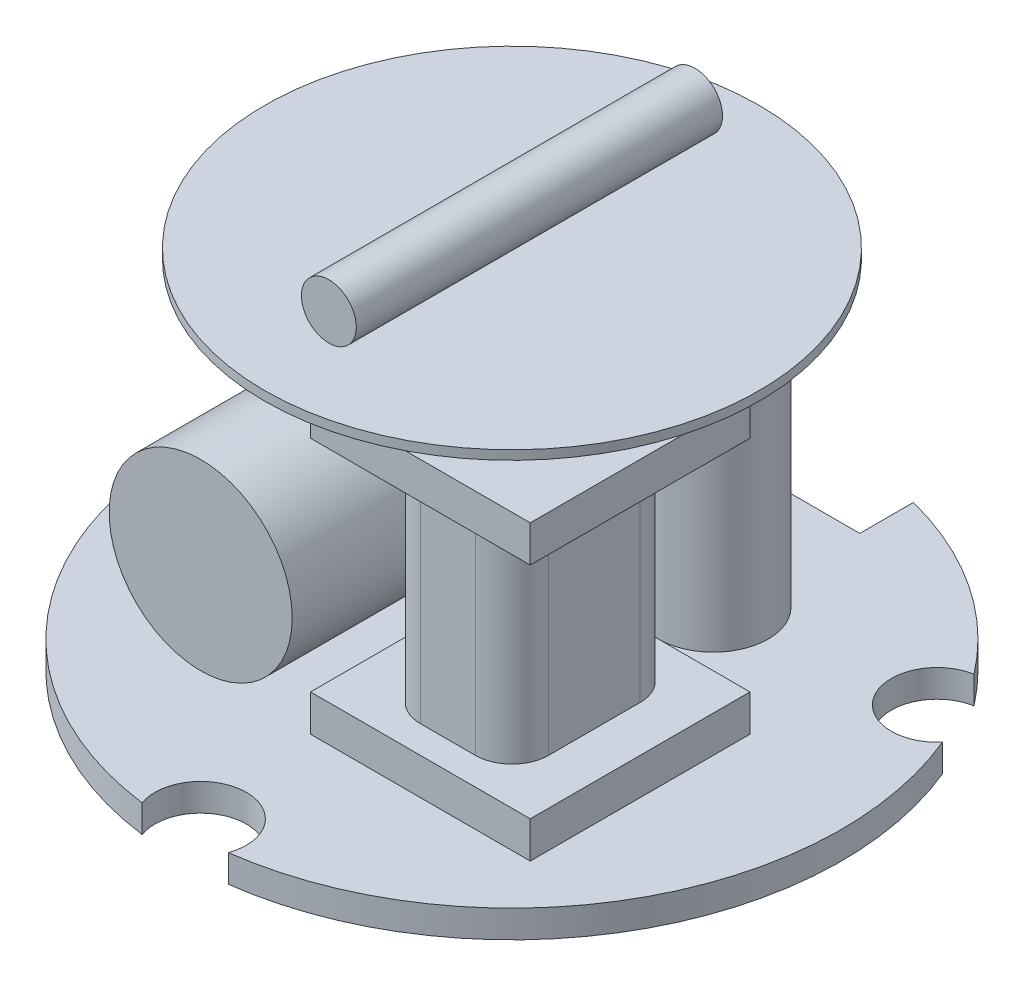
ISO-10303-21;
HEADER;
FILE_DESCRIPTION(('STEP AP214'),'2;1');
FILE_NAME('part.step','',(''),(''),'','','');
FILE_SCHEMA(('AUTOMOTIVE_DESIGN { 1 0 10303 214 1 1 1 1 }'));
ENDSEC;
DATA;
#1=APPLICATION_CONTEXT('core data for automotive mechanical design processes');
#2=APPLICATION_PROTOCOL_DEFINITION('international standard','automotive_design',2000,#1);
#3=PRODUCT_CONTEXT('',#1,'mechanical');
#4=PRODUCT('Part','Part','',(#3));
#5=PRODUCT_RELATED_PRODUCT_CATEGORY('part','',(#4));
#6=PRODUCT_DEFINITION_FORMATION('','',#4);
#7=PRODUCT_DEFINITION_CONTEXT('part definition',#1,'design');
#8=PRODUCT_DEFINITION('design','',#6,#7);
#9=PRODUCT_DEFINITION_SHAPE('','',#8);
#10=(LENGTH_UNIT() NAMED_UNIT(*) SI_UNIT(.MILLI.,.METRE.));
#11=(NAMED_UNIT(*) PLANE_ANGLE_UNIT() SI_UNIT($,.RADIAN.));
#12=(NAMED_UNIT(*) SI_UNIT($,.STERADIAN.) SOLID_ANGLE_UNIT());
#13=UNCERTAINTY_MEASURE_WITH_UNIT(LENGTH_MEASURE(1.E-05),#10,'distance_accuracy_value','');
#14=(GEOMETRIC_REPRESENTATION_CONTEXT(3) GLOBAL_UNCERTAINTY_ASSIGNED_CONTEXT((#13)) GLOBAL_UNIT_ASSIGNED_CONTEXT((#10,
#11,#12)) REPRESENTATION_CONTEXT('',''));
#15=CARTESIAN_POINT('',(0.,0.,0.));
#16=DIRECTION('',(0.,0.,1.));
#17=DIRECTION('',(1.,0.,0.));
#18=AXIS2_PLACEMENT_3D('',#15,#16,#17);
#19=CARTESIAN_POINT('',(0.,22.,10.));
#20=DIRECTION('',(0.,0.,-1.));
#21=DIRECTION('',(-1.,0.,0.));
#22=AXIS2_PLACEMENT_3D('',#19,#20,#21);
#23=CYLINDRICAL_SURFACE('',#22,1.5);
#24=CARTESIAN_POINT('',(0.,22.,10.));
#25=DIRECTION('',(0.,0.,1.));
#26=DIRECTION('',(1.,0.,0.));
#27=AXIS2_PLACEMENT_3D('',#24,#25,#26);
#28=CIRCLE('',#27,1.5);
#29=CARTESIAN_POINT('',(1.5,22.,10.));
#30=VERTEX_POINT('',#29);
#31=EDGE_CURVE('E11',#30,#30,#28,.T.);
#32=ORIENTED_EDGE('',*,*,#31,.F.);
#33=EDGE_LOOP('',(#32));
#34=FACE_BOUND('',#33,.T.);
#35=CARTESIAN_POINT('',(0.,22.,-10.));
#36=DIRECTION('',(0.,0.,1.));
#37=DIRECTION('',(1.,0.,0.));
#38=AXIS2_PLACEMENT_3D('',#35,#36,#37);
#39=CIRCLE('',#38,1.5);
#40=CARTESIAN_POINT('',(1.5,22.,-10.));
#41=VERTEX_POINT('',#40);
#42=EDGE_CURVE('E46',#41,#41,#39,.T.);
#43=ORIENTED_EDGE('',*,*,#42,.T.);
#44=EDGE_LOOP('',(#43));
#45=FACE_BOUND('',#44,.T.);
#46=ADVANCED_FACE('F40',(#34,#45),#23,.T.);
#47=CARTESIAN_POINT('',(0.,22.,10.));
#48=DIRECTION('',(0.,0.,1.));
#49=DIRECTION('',(1.,0.,0.));
#50=AXIS2_PLACEMENT_3D('',#47,#48,#49);
#51=PLANE('',#50);
#52=ORIENTED_EDGE('',*,*,#31,.T.);
#53=EDGE_LOOP('',(#52));
#54=FACE_BOUND('',#53,.T.);
#55=ADVANCED_FACE('F55',(#54),#51,.T.);
#56=CARTESIAN_POINT('',(0.,22.,-10.));
#57=DIRECTION('',(0.,0.,1.));
#58=DIRECTION('',(1.,0.,0.));
#59=AXIS2_PLACEMENT_3D('',#56,#57,#58);
#60=PLANE('',#59);
#61=ORIENTED_EDGE('',*,*,#42,.F.);
#62=EDGE_LOOP('',(#61));
#63=FACE_BOUND('',#62,.T.);
#64=ADVANCED_FACE('F53',(#63),#60,.F.);
#65=CLOSED_SHELL('',(#46,#55,#64));
#66=MANIFOLD_SOLID_BREP('B2',#65);
#67=CARTESIAN_POINT('',(-7.,6.5,10.));
#68=DIRECTION('',(0.,0.,-1.));
#69=DIRECTION('',(-1.,0.,0.));
#70=AXIS2_PLACEMENT_3D('',#67,#68,#69);
#71=CYLINDRICAL_SURFACE('',#70,5.);
#72=CARTESIAN_POINT('',(-7.,6.5,10.));
#73=DIRECTION('',(0.,0.,1.));
#74=DIRECTION('',(1.,0.,0.));
#75=AXIS2_PLACEMENT_3D('',#72,#73,#74);
#76=CIRCLE('',#75,5.);
#77=CARTESIAN_POINT('',(-2.,6.5,10.));
#78=VERTEX_POINT('',#77);
#79=EDGE_CURVE('E39',#78,#78,#76,.T.);
#80=ORIENTED_EDGE('',*,*,#79,.F.);
#81=EDGE_LOOP('',(#80));
#82=FACE_BOUND('',#81,.T.);
#83=CARTESIAN_POINT('',(-7.,6.5,-4.));
#84=DIRECTION('',(0.,0.,1.));
#85=DIRECTION('',(1.,0.,0.));
#86=AXIS2_PLACEMENT_3D('',#83,#84,#85);
#87=CIRCLE('',#86,5.);
#88=CARTESIAN_POINT('',(-2.,6.5,-4.));
#89=VERTEX_POINT('',#88);
#90=EDGE_CURVE('E96',#89,#89,#87,.T.);
#91=ORIENTED_EDGE('',*,*,#90,.T.);
#92=EDGE_LOOP('',(#91));
#93=FACE_BOUND('',#92,.T.);
#94=ADVANCED_FACE('F90',(#82,#93),#71,.T.);
#95=CARTESIAN_POINT('',(-7.,6.5,10.));
#96=DIRECTION('',(0.,0.,1.));
#97=DIRECTION('',(1.,0.,0.));
#98=AXIS2_PLACEMENT_3D('',#95,#96,#97);
#99=PLANE('',#98);
#100=ORIENTED_EDGE('',*,*,#79,.T.);
#101=EDGE_LOOP('',(#100));
#102=FACE_BOUND('',#101,.T.);
#103=ADVANCED_FACE('F105',(#102),#99,.T.);
#104=CARTESIAN_POINT('',(-7.,6.5,-4.));
#105=DIRECTION('',(0.,0.,1.));
#106=DIRECTION('',(1.,0.,0.));
#107=AXIS2_PLACEMENT_3D('',#104,#105,#106);
#108=PLANE('',#107);
#109=ORIENTED_EDGE('',*,*,#90,.F.);
#110=EDGE_LOOP('',(#109));
#111=FACE_BOUND('',#110,.T.);
#112=ADVANCED_FACE('F103',(#111),#108,.F.);
#113=CLOSED_SHELL('',(#94,#103,#112));
#114=MANIFOLD_SOLID_BREP('B6',#113);
#115=CARTESIAN_POINT('',(11.,17.5,10.));
#116=DIRECTION('',(0.,-1.,0.));
#117=DIRECTION('',(0.,0.,-1.));
#118=AXIS2_PLACEMENT_3D('',#115,#116,#117);
#119=PLANE('',#118);
#120=DIRECTION('',(0.,0.,-1.));
#121=VECTOR('',#120,1.);
#122=CARTESIAN_POINT('',(11.,17.5,-2.));
#123=LINE('',#122,#121);
#124=CARTESIAN_POINT('',(11.,17.5,10.));
#125=VERTEX_POINT('',#124);
#126=CARTESIAN_POINT('',(11.,17.5,-2.));
#127=VERTEX_POINT('',#126);
#128=EDGE_CURVE('E398',#125,#127,#123,.T.);
#129=ORIENTED_EDGE('',*,*,#128,.T.);
#130=DIRECTION('',(-1.,0.,0.));
#131=VECTOR('',#130,1.);
#132=CARTESIAN_POINT('',(11.,17.5,-2.));
#133=LINE('',#132,#131);
#134=CARTESIAN_POINT('',(-1.,17.5,-2.));
#135=VERTEX_POINT('',#134);
#136=EDGE_CURVE('E401',#127,#135,#133,.T.);
#137=ORIENTED_EDGE('',*,*,#136,.T.);
#138=DIRECTION('',(0.,0.,1.));
#139=VECTOR('',#138,1.);
#140=CARTESIAN_POINT('',(-1.,17.5,-2.));
#141=LINE('',#140,#139);
#142=CARTESIAN_POINT('',(-1.,17.5,10.));
#143=VERTEX_POINT('',#142);
#144=EDGE_CURVE('E403',#135,#143,#141,.T.);
#145=ORIENTED_EDGE('',*,*,#144,.T.);
#146=DIRECTION('',(1.,0.,0.));
#147=VECTOR('',#146,1.);
#148=CARTESIAN_POINT('',(11.,17.5,10.));
#149=LINE('',#148,#147);
#150=EDGE_CURVE('E405',#143,#125,#149,.T.);
#151=ORIENTED_EDGE('',*,*,#150,.T.);
#152=EDGE_LOOP('',(#129,#137,#145,#151));
#153=FACE_BOUND('',#152,.T.);
#154=DIRECTION('',(0.,0.,-1.));
#155=VECTOR('',#154,1.);
#156=CARTESIAN_POINT('',(7.5,17.5,1.5));
#157=LINE('',#156,#155);
#158=CARTESIAN_POINT('',(7.5,17.5,6.5));
#159=VERTEX_POINT('',#158);
#160=CARTESIAN_POINT('',(7.5,17.5,1.5));
#161=VERTEX_POINT('',#160);
#162=EDGE_CURVE('E1182',#159,#161,#157,.T.);
#163=ORIENTED_EDGE('',*,*,#162,.F.);
#164=DIRECTION('',(1.,0.,0.));
#165=VECTOR('',#164,1.);
#166=CARTESIAN_POINT('',(7.5,17.5,6.5));
#167=LINE('',#166,#165);
#168=CARTESIAN_POINT('',(2.5,17.5,6.5));
#169=VERTEX_POINT('',#168);
#170=EDGE_CURVE('E366',#169,#159,#167,.T.);
#171=ORIENTED_EDGE('',*,*,#170,.F.);
#172=DIRECTION('',(0.,0.,1.));
#173=VECTOR('',#172,1.);
#174=CARTESIAN_POINT('',(2.5,17.5,1.5));
#175=LINE('',#174,#173);
#176=CARTESIAN_POINT('',(2.5,17.5,1.5));
#177=VERTEX_POINT('',#176);
#178=EDGE_CURVE('E151',#177,#169,#175,.T.);
#179=ORIENTED_EDGE('',*,*,#178,.F.);
#180=DIRECTION('',(-1.,0.,0.));
#181=VECTOR('',#180,1.);
#182=CARTESIAN_POINT('',(7.5,17.5,1.5));
#183=LINE('',#182,#181);
#184=EDGE_CURVE('E146',#161,#177,#183,.T.);
#185=ORIENTED_EDGE('',*,*,#184,.F.);
#186=EDGE_LOOP('',(#163,#171,#179,#185));
#187=FACE_BOUND('',#186,.T.);
#188=ADVANCED_FACE('F131',(#153,#187),#119,.F.);
#189=CARTESIAN_POINT('',(11.,3.5,10.));
#190=DIRECTION('',(0.,-1.,0.));
#191=DIRECTION('',(0.,0.,-1.));
#192=AXIS2_PLACEMENT_3D('',#189,#190,#191);
#193=PLANE('',#192);
#194=DIRECTION('',(0.,0.,-1.));
#195=VECTOR('',#194,1.);
#196=CARTESIAN_POINT('',(11.,3.5,-2.));
#197=LINE('',#196,#195);
#198=CARTESIAN_POINT('',(11.,3.5,10.));
#199=VERTEX_POINT('',#198);
#200=CARTESIAN_POINT('',(11.,3.5,-2.));
#201=VERTEX_POINT('',#200);
#202=EDGE_CURVE('E501',#199,#201,#197,.T.);
#203=ORIENTED_EDGE('',*,*,#202,.T.);
#204=DIRECTION('',(-1.,0.,0.));
#205=VECTOR('',#204,1.);
#206=CARTESIAN_POINT('',(11.,3.5,-2.));
#207=LINE('',#206,#205);
#208=CARTESIAN_POINT('',(-1.,3.5,-2.));
#209=VERTEX_POINT('',#208);
#210=EDGE_CURVE('E504',#201,#209,#207,.T.);
#211=ORIENTED_EDGE('',*,*,#210,.T.);
#212=DIRECTION('',(0.,0.,1.));
#213=VECTOR('',#212,1.);
#214=CARTESIAN_POINT('',(-1.,3.5,-2.));
#215=LINE('',#214,#213);
#216=CARTESIAN_POINT('',(-0.999999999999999,3.5,10.));
#217=VERTEX_POINT('',#216);
#218=EDGE_CURVE('E506',#209,#217,#215,.T.);
#219=ORIENTED_EDGE('',*,*,#218,.T.);
#220=DIRECTION('',(1.,0.,0.));
#221=VECTOR('',#220,1.);
#222=CARTESIAN_POINT('',(11.,3.5,10.));
#223=LINE('',#222,#221);
#224=EDGE_CURVE('E508',#217,#199,#223,.T.);
#225=ORIENTED_EDGE('',*,*,#224,.T.);
#226=EDGE_LOOP('',(#203,#211,#219,#225));
#227=FACE_BOUND('',#226,.T.);
#228=CARTESIAN_POINT('',(6.5,3.5,6.5));
#229=DIRECTION('',(0.,1.,0.));
#230=DIRECTION('',(0.,0.,1.));
#231=AXIS2_PLACEMENT_3D('',#228,#229,#230);
#232=CIRCLE('',#231,2.);
#233=CARTESIAN_POINT('',(6.5,3.5,8.5));
#234=VERTEX_POINT('',#233);
#235=CARTESIAN_POINT('',(8.5,3.5,6.5));
#236=VERTEX_POINT('',#235);
#237=EDGE_CURVE('E419',#234,#236,#232,.T.);
#238=ORIENTED_EDGE('',*,*,#237,.F.);
#239=DIRECTION('',(1.,0.,0.));
#240=VECTOR('',#239,1.);
#241=CARTESIAN_POINT('',(6.5,3.5,8.5));
#242=LINE('',#241,#240);
#243=CARTESIAN_POINT('',(3.5,3.5,8.5));
#244=VERTEX_POINT('',#243);
#245=EDGE_CURVE('E440',#244,#234,#242,.T.);
#246=ORIENTED_EDGE('',*,*,#245,.F.);
#247=CARTESIAN_POINT('',(3.5,3.5,6.5));
#248=DIRECTION('',(0.,1.,0.));
#249=DIRECTION('',(0.,0.,1.));
#250=AXIS2_PLACEMENT_3D('',#247,#248,#249);
#251=CIRCLE('',#250,2.);
#252=CARTESIAN_POINT('',(1.5,3.5,6.5));
#253=VERTEX_POINT('',#252);
#254=EDGE_CURVE('E437',#253,#244,#251,.T.);
#255=ORIENTED_EDGE('',*,*,#254,.F.);
#256=DIRECTION('',(0.,0.,1.));
#257=VECTOR('',#256,1.);
#258=CARTESIAN_POINT('',(1.5,3.5,1.5));
#259=LINE('',#258,#257);
#260=CARTESIAN_POINT('',(1.5,3.5,1.5));
#261=VERTEX_POINT('',#260);
#262=EDGE_CURVE('E434',#261,#253,#259,.T.);
#263=ORIENTED_EDGE('',*,*,#262,.F.);
#264=CARTESIAN_POINT('',(3.5,3.5,1.5));
#265=DIRECTION('',(0.,1.,0.));
#266=DIRECTION('',(0.,0.,1.));
#267=AXIS2_PLACEMENT_3D('',#264,#265,#266);
#268=CIRCLE('',#267,2.);
#269=CARTESIAN_POINT('',(3.5,3.5,-0.499999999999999));
#270=VERTEX_POINT('',#269);
#271=EDGE_CURVE('E431',#270,#261,#268,.T.);
#272=ORIENTED_EDGE('',*,*,#271,.F.);
#273=DIRECTION('',(-1.,0.,0.));
#274=VECTOR('',#273,1.);
#275=CARTESIAN_POINT('',(6.5,3.5,-0.499999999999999));
#276=LINE('',#275,#274);
#277=CARTESIAN_POINT('',(6.5,3.5,-0.499999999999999));
#278=VERTEX_POINT('',#277);
#279=EDGE_CURVE('E428',#278,#270,#276,.T.);
#280=ORIENTED_EDGE('',*,*,#279,.F.);
#281=CARTESIAN_POINT('',(6.5,3.5,1.5));
#282=DIRECTION('',(0.,1.,0.));
#283=DIRECTION('',(0.,0.,1.));
#284=AXIS2_PLACEMENT_3D('',#281,#282,#283);
#285=CIRCLE('',#284,2.);
#286=CARTESIAN_POINT('',(8.5,3.5,1.5));
#287=VERTEX_POINT('',#286);
#288=EDGE_CURVE('E425',#287,#278,#285,.T.);
#289=ORIENTED_EDGE('',*,*,#288,.F.);
#290=DIRECTION('',(0.,0.,-1.));
#291=VECTOR('',#290,1.);
#292=CARTESIAN_POINT('',(8.5,3.5,1.5));
#293=LINE('',#292,#291);
#294=EDGE_CURVE('E422',#236,#287,#293,.T.);
#295=ORIENTED_EDGE('',*,*,#294,.F.);
#296=EDGE_LOOP('',(#238,#246,#255,#263,#272,#280,#289,#295));
#297=FACE_BOUND('',#296,.T.);
#298=ADVANCED_FACE('F674',(#227,#297),#193,.F.);
#299=CARTESIAN_POINT('',(14.7224318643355,1.5,-8.49999999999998));
#300=DIRECTION('',(0.,1.,0.));
#301=DIRECTION('',(0.,0.,1.));
#302=AXIS2_PLACEMENT_3D('',#299,#300,#301);
#303=PLANE('',#302);
#304=DIRECTION('',(-1.,0.,0.));
#305=VECTOR('',#304,1.);
#306=CARTESIAN_POINT('',(-2.,1.5,-9.));
#307=LINE('',#306,#305);
#308=CARTESIAN_POINT('',(-2.,1.5,-9.));
#309=VERTEX_POINT('',#308);
#310=CARTESIAN_POINT('',(-7.,1.5,-9.));
#311=VERTEX_POINT('',#310);
#312=EDGE_CURVE('E526',#309,#311,#307,.T.);
#313=ORIENTED_EDGE('',*,*,#312,.F.);
#314=DIRECTION('',(0.,0.,-1.));
#315=VECTOR('',#314,1.);
#316=CARTESIAN_POINT('',(-2.,1.5,-9.));
#317=LINE('',#316,#315);
#318=CARTESIAN_POINT('',(-2.,1.5,-5.));
#319=VERTEX_POINT('',#318);
#320=EDGE_CURVE('E523',#319,#309,#317,.T.);
#321=ORIENTED_EDGE('',*,*,#320,.F.);
#322=DIRECTION('',(1.,0.,0.));
#323=VECTOR('',#322,1.);
#324=CARTESIAN_POINT('',(-2.,1.5,-5.));
#325=LINE('',#324,#323);
#326=CARTESIAN_POINT('',(-7.,1.5,-5.));
#327=VERTEX_POINT('',#326);
#328=EDGE_CURVE('E532',#327,#319,#325,.T.);
#329=ORIENTED_EDGE('',*,*,#328,.F.);
#330=DIRECTION('',(0.,0.,1.));
#331=VECTOR('',#330,1.);
#332=CARTESIAN_POINT('',(-7.,1.5,-9.));
#333=LINE('',#332,#331);
#334=EDGE_CURVE('E529',#311,#327,#333,.T.);
#335=ORIENTED_EDGE('',*,*,#334,.F.);
#336=EDGE_LOOP('',(#313,#321,#329,#335));
#337=FACE_BOUND('',#336,.T.);
#338=CARTESIAN_POINT('',(14.7224318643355,1.5,-8.49999999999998));
#339=DIRECTION('',(0.,-1.,0.));
#340=DIRECTION('',(0.,0.,1.));
#341=AXIS2_PLACEMENT_3D('',#338,#339,#340);
#342=CIRCLE('',#341,2.5);
#343=CARTESIAN_POINT('',(16.6310597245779,1.5,-6.88533604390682));
#344=VERTEX_POINT('',#343);
#345=CARTESIAN_POINT('',(14.278405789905,1.5,-10.9602521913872));
#346=VERTEX_POINT('',#345);
#347=EDGE_CURVE('E573',#344,#346,#342,.T.);
#348=ORIENTED_EDGE('',*,*,#347,.T.);
#349=CARTESIAN_POINT('',(0.,1.5,0.));
#350=DIRECTION('',(0.,1.,0.));
#351=DIRECTION('',(0.,0.,1.));
#352=AXIS2_PLACEMENT_3D('',#349,#350,#351);
#353=CIRCLE('',#352,18.);
#354=CARTESIAN_POINT('',(4.49999999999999,1.5,-17.4284250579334));
#355=VERTEX_POINT('',#354);
#356=EDGE_CURVE('E576',#346,#355,#353,.T.);
#357=ORIENTED_EDGE('',*,*,#356,.T.);
#358=DIRECTION('',(0.,0.,1.));
#359=VECTOR('',#358,1.);
#360=CARTESIAN_POINT('',(4.49999999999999,1.5,-17.4284250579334));
#361=LINE('',#360,#359);
#362=CARTESIAN_POINT('',(4.5,1.5,-14.5));
#363=VERTEX_POINT('',#362);
#364=EDGE_CURVE('E578',#355,#363,#361,.T.);
#365=ORIENTED_EDGE('',*,*,#364,.T.);
#366=DIRECTION('',(-1.,0.,0.));
#367=VECTOR('',#366,1.);
#368=CARTESIAN_POINT('',(-4.5,1.5,-14.5));
#369=LINE('',#368,#367);
#370=CARTESIAN_POINT('',(-4.5,1.5,-14.5));
#371=VERTEX_POINT('',#370);
#372=EDGE_CURVE('E580',#363,#371,#369,.T.);
#373=ORIENTED_EDGE('',*,*,#372,.T.);
#374=DIRECTION('',(0.,0.,-1.));
#375=VECTOR('',#374,1.);
#376=CARTESIAN_POINT('',(-4.5,1.5,-17.4284250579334));
#377=LINE('',#376,#375);
#378=CARTESIAN_POINT('',(-4.49999999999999,1.5,-17.4284250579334));
#379=VERTEX_POINT('',#378);
#380=EDGE_CURVE('E582',#371,#379,#377,.T.);
#381=ORIENTED_EDGE('',*,*,#380,.T.);
#382=CARTESIAN_POINT('',(0.,1.5,0.));
#383=DIRECTION('',(0.,1.,0.));
#384=DIRECTION('',(0.,0.,1.));
#385=AXIS2_PLACEMENT_3D('',#382,#383,#384);
#386=CIRCLE('',#385,18.);
#387=CARTESIAN_POINT('',(-14.278405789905,1.5,-10.9602521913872));
#388=VERTEX_POINT('',#387);
#389=EDGE_CURVE('E584',#379,#388,#386,.T.);
#390=ORIENTED_EDGE('',*,*,#389,.T.);
#391=CARTESIAN_POINT('',(-14.7224318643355,1.5,-8.49999999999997));
#392=DIRECTION('',(0.,-1.,0.));
#393=DIRECTION('',(0.,0.,-1.));
#394=AXIS2_PLACEMENT_3D('',#391,#392,#393);
#395=CIRCLE('',#394,2.5);
#396=CARTESIAN_POINT('',(-16.6310597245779,1.5,-6.88533604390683));
#397=VERTEX_POINT('',#396);
#398=EDGE_CURVE('E586',#388,#397,#395,.T.);
#399=ORIENTED_EDGE('',*,*,#398,.T.);
#400=CARTESIAN_POINT('',(0.,1.5,0.));
#401=DIRECTION('',(0.,1.,0.));
#402=DIRECTION('',(0.,0.,1.));
#403=AXIS2_PLACEMENT_3D('',#400,#401,#402);
#404=CIRCLE('',#403,18.);
#405=CARTESIAN_POINT('',(-2.35265393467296,1.5,17.8455882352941));
#406=VERTEX_POINT('',#405);
#407=EDGE_CURVE('E588',#397,#406,#404,.T.);
#408=ORIENTED_EDGE('',*,*,#407,.T.);
#409=CARTESIAN_POINT('',(0.,1.5,17.));
#410=DIRECTION('',(0.,-1.,0.));
#411=DIRECTION('',(0.,0.,1.));
#412=AXIS2_PLACEMENT_3D('',#409,#410,#411);
#413=CIRCLE('',#412,2.5);
#414=CARTESIAN_POINT('',(2.35265393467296,1.5,17.8455882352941));
#415=VERTEX_POINT('',#414);
#416=EDGE_CURVE('E590',#406,#415,#413,.T.);
#417=ORIENTED_EDGE('',*,*,#416,.T.);
#418=CARTESIAN_POINT('',(0.,1.5,0.));
#419=DIRECTION('',(0.,1.,0.));
#420=DIRECTION('',(0.,0.,1.));
#421=AXIS2_PLACEMENT_3D('',#418,#419,#420);
#422=CIRCLE('',#421,18.);
#423=EDGE_CURVE('E592',#415,#344,#422,.T.);
#424=ORIENTED_EDGE('',*,*,#423,.T.);
#425=EDGE_LOOP('',(#348,#357,#365,#373,#381,#390,#399,#408,#417,#424));
#426=FACE_BOUND('',#425,.T.);
#427=CARTESIAN_POINT('',(4.,1.5,-7.));
#428=DIRECTION('',(0.,1.,0.));
#429=DIRECTION('',(0.,0.,1.));
#430=AXIS2_PLACEMENT_3D('',#427,#428,#429);
#431=CIRCLE('',#430,3.);
#432=CARTESIAN_POINT('',(4.,1.5,-4.));
#433=VERTEX_POINT('',#432);
#434=EDGE_CURVE('E543',#433,#433,#431,.T.);
#435=ORIENTED_EDGE('',*,*,#434,.F.);
#436=EDGE_LOOP('',(#435));
#437=FACE_BOUND('',#436,.T.);
#438=DIRECTION('',(-1.,0.,0.));
#439=VECTOR('',#438,1.);
#440=CARTESIAN_POINT('',(11.,1.5,-2.));
#441=LINE('',#440,#439);
#442=CARTESIAN_POINT('',(11.,1.5,-2.));
#443=VERTEX_POINT('',#442);
#444=CARTESIAN_POINT('',(-1.,1.5,-2.));
#445=VERTEX_POINT('',#444);
#446=EDGE_CURVE('E494',#443,#445,#441,.T.);
#447=ORIENTED_EDGE('',*,*,#446,.F.);
#448=DIRECTION('',(0.,0.,-1.));
#449=VECTOR('',#448,1.);
#450=CARTESIAN_POINT('',(11.,1.5,-2.));
#451=LINE('',#450,#449);
#452=CARTESIAN_POINT('',(11.,1.5,10.));
#453=VERTEX_POINT('',#452);
#454=EDGE_CURVE('E491',#453,#443,#451,.T.);
#455=ORIENTED_EDGE('',*,*,#454,.F.);
#456=DIRECTION('',(1.,0.,0.));
#457=VECTOR('',#456,1.);
#458=CARTESIAN_POINT('',(11.,1.5,10.));
#459=LINE('',#458,#457);
#460=CARTESIAN_POINT('',(-0.999999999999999,1.5,10.));
#461=VERTEX_POINT('',#460);
#462=EDGE_CURVE('E499',#461,#453,#459,.T.);
#463=ORIENTED_EDGE('',*,*,#462,.F.);
#464=DIRECTION('',(0.,0.,1.));
#465=VECTOR('',#464,1.);
#466=CARTESIAN_POINT('',(-1.,1.5,-2.));
#467=LINE('',#466,#465);
#468=EDGE_CURVE('E496',#445,#461,#467,.T.);
#469=ORIENTED_EDGE('',*,*,#468,.F.);
#470=EDGE_LOOP('',(#447,#455,#463,#469));
#471=FACE_BOUND('',#470,.T.);
#472=ADVANCED_FACE('F660',(#337,#426,#437,#471),#303,.T.);
#473=CARTESIAN_POINT('',(14.7224318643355,0.,-8.49999999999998));
#474=DIRECTION('',(0.,1.,0.));
#475=DIRECTION('',(0.,0.,1.));
#476=AXIS2_PLACEMENT_3D('',#473,#474,#475);
#477=PLANE('',#476);
#478=CARTESIAN_POINT('',(14.7224318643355,0.,-8.49999999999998));
#479=DIRECTION('',(0.,-1.,0.));
#480=DIRECTION('',(0.,0.,1.));
#481=AXIS2_PLACEMENT_3D('',#478,#479,#480);
#482=CIRCLE('',#481,2.5);
#483=CARTESIAN_POINT('',(16.6310597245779,0.,-6.88533604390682));
#484=VERTEX_POINT('',#483);
#485=CARTESIAN_POINT('',(14.278405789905,0.,-10.9602521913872));
#486=VERTEX_POINT('',#485);
#487=EDGE_CURVE('E552',#484,#486,#482,.T.);
#488=ORIENTED_EDGE('',*,*,#487,.F.);
#489=CARTESIAN_POINT('',(0.,0.,0.));
#490=DIRECTION('',(0.,1.,0.));
#491=DIRECTION('',(0.,0.,1.));
#492=AXIS2_PLACEMENT_3D('',#489,#490,#491);
#493=CIRCLE('',#492,18.);
#494=CARTESIAN_POINT('',(2.35265393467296,0.,17.8455882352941));
#495=VERTEX_POINT('',#494);
#496=EDGE_CURVE('E571',#495,#484,#493,.T.);
#497=ORIENTED_EDGE('',*,*,#496,.F.);
#498=CARTESIAN_POINT('',(0.,0.,17.));
#499=DIRECTION('',(0.,-1.,0.));
#500=DIRECTION('',(0.,0.,1.));
#501=AXIS2_PLACEMENT_3D('',#498,#499,#500);
#502=CIRCLE('',#501,2.5);
#503=CARTESIAN_POINT('',(-2.35265393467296,0.,17.8455882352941));
#504=VERTEX_POINT('',#503);
#505=EDGE_CURVE('E569',#504,#495,#502,.T.);
#506=ORIENTED_EDGE('',*,*,#505,.F.);
#507=CARTESIAN_POINT('',(0.,0.,0.));
#508=DIRECTION('',(0.,1.,0.));
#509=DIRECTION('',(0.,0.,1.));
#510=AXIS2_PLACEMENT_3D('',#507,#508,#509);
#511=CIRCLE('',#510,18.);
#512=CARTESIAN_POINT('',(-16.6310597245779,0.,-6.88533604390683));
#513=VERTEX_POINT('',#512);
#514=EDGE_CURVE('E567',#513,#504,#511,.T.);
#515=ORIENTED_EDGE('',*,*,#514,.F.);
#516=CARTESIAN_POINT('',(-14.7224318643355,0.,-8.49999999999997));
#517=DIRECTION('',(0.,-1.,0.));
#518=DIRECTION('',(0.,0.,-1.));
#519=AXIS2_PLACEMENT_3D('',#516,#517,#518);
#520=CIRCLE('',#519,2.5);
#521=CARTESIAN_POINT('',(-14.278405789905,0.,-10.9602521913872));
#522=VERTEX_POINT('',#521);
#523=EDGE_CURVE('E565',#522,#513,#520,.T.);
#524=ORIENTED_EDGE('',*,*,#523,.F.);
#525=CARTESIAN_POINT('',(0.,0.,0.));
#526=DIRECTION('',(0.,1.,0.));
#527=DIRECTION('',(0.,0.,1.));
#528=AXIS2_PLACEMENT_3D('',#525,#526,#527);
#529=CIRCLE('',#528,18.);
#530=CARTESIAN_POINT('',(-4.49999999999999,0.,-17.4284250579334));
#531=VERTEX_POINT('',#530);
#532=EDGE_CURVE('E563',#531,#522,#529,.T.);
#533=ORIENTED_EDGE('',*,*,#532,.F.);
#534=DIRECTION('',(0.,0.,-1.));
#535=VECTOR('',#534,1.);
#536=CARTESIAN_POINT('',(-4.5,0.,-17.4284250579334));
#537=LINE('',#536,#535);
#538=CARTESIAN_POINT('',(-4.5,0.,-14.5));
#539=VERTEX_POINT('',#538);
#540=EDGE_CURVE('E561',#539,#531,#537,.T.);
#541=ORIENTED_EDGE('',*,*,#540,.F.);
#542=DIRECTION('',(-1.,0.,0.));
#543=VECTOR('',#542,1.);
#544=CARTESIAN_POINT('',(-4.5,0.,-14.5));
#545=LINE('',#544,#543);
#546=CARTESIAN_POINT('',(4.5,0.,-14.5));
#547=VERTEX_POINT('',#546);
#548=EDGE_CURVE('E559',#547,#539,#545,.T.);
#549=ORIENTED_EDGE('',*,*,#548,.F.);
#550=DIRECTION('',(0.,0.,1.));
#551=VECTOR('',#550,1.);
#552=CARTESIAN_POINT('',(4.49999999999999,0.,-17.4284250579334));
#553=LINE('',#552,#551);
#554=CARTESIAN_POINT('',(4.49999999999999,0.,-17.4284250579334));
#555=VERTEX_POINT('',#554);
#556=EDGE_CURVE('E557',#555,#547,#553,.T.);
#557=ORIENTED_EDGE('',*,*,#556,.F.);
#558=CARTESIAN_POINT('',(0.,0.,0.));
#559=DIRECTION('',(0.,1.,0.));
#560=DIRECTION('',(0.,0.,1.));
#561=AXIS2_PLACEMENT_3D('',#558,#559,#560);
#562=CIRCLE('',#561,18.);
#563=EDGE_CURVE('E555',#486,#555,#562,.T.);
#564=ORIENTED_EDGE('',*,*,#563,.F.);
#565=EDGE_LOOP('',(#488,#497,#506,#515,#524,#533,#541,#549,#557,#564));
#566=FACE_BOUND('',#565,.T.);
#567=CARTESIAN_POINT('',(0.,0.,0.));
#568=DIRECTION('',(0.,1.,0.));
#569=DIRECTION('',(0.,0.,1.));
#570=AXIS2_PLACEMENT_3D('',#567,#568,#569);
#571=CIRCLE('',#570,5.);
#572=CARTESIAN_POINT('',(0.,0.,5.));
#573=VERTEX_POINT('',#572);
#574=EDGE_CURVE('E624',#573,#573,#571,.F.);
#575=ORIENTED_EDGE('',*,*,#574,.F.);
#576=EDGE_LOOP('',(#575));
#577=FACE_BOUND('',#576,.T.);
#578=ADVANCED_FACE('F951',(#566,#577),#477,.F.);
#579=CARTESIAN_POINT('',(14.7224318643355,1.5,-8.49999999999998));
#580=DIRECTION('',(0.,-1.,0.));
#581=DIRECTION('',(0.,0.,-1.));
#582=AXIS2_PLACEMENT_3D('',#579,#580,#581);
#583=CYLINDRICAL_SURFACE('',#582,2.5);
#584=ORIENTED_EDGE('',*,*,#487,.T.);
#585=DIRECTION('',(0.,-1.,0.));
#586=VECTOR('',#585,1.);
#587=CARTESIAN_POINT('',(14.278405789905,1.5,-10.9602521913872));
#588=LINE('',#587,#586);
#589=EDGE_CURVE('E621',#346,#486,#588,.T.);
#590=ORIENTED_EDGE('',*,*,#589,.F.);
#591=ORIENTED_EDGE('',*,*,#347,.F.);
#592=DIRECTION('',(0.,-1.,0.));
#593=VECTOR('',#592,1.);
#594=CARTESIAN_POINT('',(16.6310597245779,1.5,-6.88533604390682));
#595=LINE('',#594,#593);
#596=EDGE_CURVE('E594',#344,#484,#595,.T.);
#597=ORIENTED_EDGE('',*,*,#596,.T.);
#598=EDGE_LOOP('',(#584,#590,#591,#597));
#599=FACE_BOUND('',#598,.T.);
#600=ADVANCED_FACE('F133',(#599),#583,.F.);
#601=CARTESIAN_POINT('',(0.,1.5,0.));
#602=DIRECTION('',(0.,-1.,0.));
#603=DIRECTION('',(0.,0.,-1.));
#604=AXIS2_PLACEMENT_3D('',#601,#602,#603);
#605=CYLINDRICAL_SURFACE('',#604,18.);
#606=ORIENTED_EDGE('',*,*,#563,.T.);
#607=DIRECTION('',(0.,-1.,0.));
#608=VECTOR('',#607,1.);
#609=CARTESIAN_POINT('',(4.49999999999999,1.5,-17.4284250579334));
#610=LINE('',#609,#608);
#611=EDGE_CURVE('E618',#355,#555,#610,.T.);
#612=ORIENTED_EDGE('',*,*,#611,.F.);
#613=ORIENTED_EDGE('',*,*,#356,.F.);
#614=ORIENTED_EDGE('',*,*,#589,.T.);
#615=EDGE_LOOP('',(#606,#612,#613,#614));
#616=FACE_BOUND('',#615,.T.);
#617=ADVANCED_FACE('F1086',(#616),#605,.T.);
#618=CARTESIAN_POINT('',(4.49999999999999,1.5,-17.4284250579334));
#619=DIRECTION('',(1.,0.,0.));
#620=DIRECTION('',(0.,0.,-1.));
#621=AXIS2_PLACEMENT_3D('',#618,#619,#620);
#622=PLANE('',#621);
#623=ORIENTED_EDGE('',*,*,#556,.T.);
#624=DIRECTION('',(0.,-1.,0.));
#625=VECTOR('',#624,1.);
#626=CARTESIAN_POINT('',(4.5,1.5,-14.5));
#627=LINE('',#626,#625);
#628=EDGE_CURVE('E615',#363,#547,#627,.T.);
#629=ORIENTED_EDGE('',*,*,#628,.F.);
#630=ORIENTED_EDGE('',*,*,#364,.F.);
#631=ORIENTED_EDGE('',*,*,#611,.T.);
#632=EDGE_LOOP('',(#623,#629,#630,#631));
#633=FACE_BOUND('',#632,.T.);
#634=ADVANCED_FACE('F1077',(#633),#622,.F.);
#635=CARTESIAN_POINT('',(-4.5,1.5,-14.5));
#636=DIRECTION('',(0.,0.,1.));
#637=DIRECTION('',(1.,0.,0.));
#638=AXIS2_PLACEMENT_3D('',#635,#636,#637);
#639=PLANE('',#638);
#640=ORIENTED_EDGE('',*,*,#548,.T.);
#641=DIRECTION('',(0.,-1.,0.));
#642=VECTOR('',#641,1.);
#643=CARTESIAN_POINT('',(-4.5,1.5,-14.5));
#644=LINE('',#643,#642);
#645=EDGE_CURVE('E612',#371,#539,#644,.T.);
#646=ORIENTED_EDGE('',*,*,#645,.F.);
#647=ORIENTED_EDGE('',*,*,#372,.F.);
#648=ORIENTED_EDGE('',*,*,#628,.T.);
#649=EDGE_LOOP('',(#640,#646,#647,#648));
#650=FACE_BOUND('',#649,.T.);
#651=ADVANCED_FACE('F1068',(#650),#639,.F.);
#652=CARTESIAN_POINT('',(-4.5,1.5,-17.4284250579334));
#653=DIRECTION('',(-1.,0.,0.));
#654=DIRECTION('',(0.,0.,1.));
#655=AXIS2_PLACEMENT_3D('',#652,#653,#654);
#656=PLANE('',#655);
#657=ORIENTED_EDGE('',*,*,#540,.T.);
#658=DIRECTION('',(0.,-1.,0.));
#659=VECTOR('',#658,1.);
#660=CARTESIAN_POINT('',(-4.49999999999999,1.5,-17.4284250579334));
#661=LINE('',#660,#659);
#662=EDGE_CURVE('E609',#379,#531,#661,.T.);
#663=ORIENTED_EDGE('',*,*,#662,.F.);
#664=ORIENTED_EDGE('',*,*,#380,.F.);
#665=ORIENTED_EDGE('',*,*,#645,.T.);
#666=EDGE_LOOP('',(#657,#663,#664,#665));
#667=FACE_BOUND('',#666,.T.);
#668=ADVANCED_FACE('F1059',(#667),#656,.F.);
#669=CARTESIAN_POINT('',(0.,1.5,0.));
#670=DIRECTION('',(0.,-1.,0.));
#671=DIRECTION('',(0.,0.,-1.));
#672=AXIS2_PLACEMENT_3D('',#669,#670,#671);
#673=CYLINDRICAL_SURFACE('',#672,18.);
#674=ORIENTED_EDGE('',*,*,#532,.T.);
#675=DIRECTION('',(0.,-1.,0.));
#676=VECTOR('',#675,1.);
#677=CARTESIAN_POINT('',(-14.278405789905,1.5,-10.9602521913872));
#678=LINE('',#677,#676);
#679=EDGE_CURVE('E606',#388,#522,#678,.T.);
#680=ORIENTED_EDGE('',*,*,#679,.F.);
#681=ORIENTED_EDGE('',*,*,#389,.F.);
#682=ORIENTED_EDGE('',*,*,#662,.T.);
#683=EDGE_LOOP('',(#674,#680,#681,#682));
#684=FACE_BOUND('',#683,.T.);
#685=ADVANCED_FACE('F1050',(#684),#673,.T.);
#686=CARTESIAN_POINT('',(-14.7224318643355,1.5,-8.49999999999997));
#687=DIRECTION('',(0.,-1.,0.));
#688=DIRECTION('',(0.,0.,-1.));
#689=AXIS2_PLACEMENT_3D('',#686,#687,#688);
#690=CYLINDRICAL_SURFACE('',#689,2.5);
#691=ORIENTED_EDGE('',*,*,#523,.T.);
#692=DIRECTION('',(0.,-1.,0.));
#693=VECTOR('',#692,1.);
#694=CARTESIAN_POINT('',(-16.6310597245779,1.5,-6.88533604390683));
#695=LINE('',#694,#693);
#696=EDGE_CURVE('E603',#397,#513,#695,.T.);
#697=ORIENTED_EDGE('',*,*,#696,.F.);
#698=ORIENTED_EDGE('',*,*,#398,.F.);
#699=ORIENTED_EDGE('',*,*,#679,.T.);
#700=EDGE_LOOP('',(#691,#697,#698,#699));
#701=FACE_BOUND('',#700,.T.);
#702=ADVANCED_FACE('F1041',(#701),#690,.F.);
#703=CARTESIAN_POINT('',(0.,1.5,0.));
#704=DIRECTION('',(0.,-1.,0.));
#705=DIRECTION('',(0.,0.,-1.));
#706=AXIS2_PLACEMENT_3D('',#703,#704,#705);
#707=CYLINDRICAL_SURFACE('',#706,18.);
#708=ORIENTED_EDGE('',*,*,#514,.T.);
#709=DIRECTION('',(0.,-1.,0.));
#710=VECTOR('',#709,1.);
#711=CARTESIAN_POINT('',(-2.35265393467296,1.5,17.8455882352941));
#712=LINE('',#711,#710);
#713=EDGE_CURVE('E600',#406,#504,#712,.T.);
#714=ORIENTED_EDGE('',*,*,#713,.F.);
#715=ORIENTED_EDGE('',*,*,#407,.F.);
#716=ORIENTED_EDGE('',*,*,#696,.T.);
#717=EDGE_LOOP('',(#708,#714,#715,#716));
#718=FACE_BOUND('',#717,.T.);
#719=ADVANCED_FACE('F1032',(#718),#707,.T.);
#720=CARTESIAN_POINT('',(0.,1.5,17.));
#721=DIRECTION('',(0.,-1.,0.));
#722=DIRECTION('',(0.,0.,-1.));
#723=AXIS2_PLACEMENT_3D('',#720,#721,#722);
#724=CYLINDRICAL_SURFACE('',#723,2.5);
#725=ORIENTED_EDGE('',*,*,#505,.T.);
#726=DIRECTION('',(0.,-1.,0.));
#727=VECTOR('',#726,1.);
#728=CARTESIAN_POINT('',(2.35265393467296,1.5,17.8455882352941));
#729=LINE('',#728,#727);
#730=EDGE_CURVE('E597',#415,#495,#729,.T.);
#731=ORIENTED_EDGE('',*,*,#730,.F.);
#732=ORIENTED_EDGE('',*,*,#416,.F.);
#733=ORIENTED_EDGE('',*,*,#713,.T.);
#734=EDGE_LOOP('',(#725,#731,#732,#733));
#735=FACE_BOUND('',#734,.T.);
#736=ADVANCED_FACE('F1023',(#735),#724,.F.);
#737=CARTESIAN_POINT('',(0.,1.5,0.));
#738=DIRECTION('',(0.,-1.,0.));
#739=DIRECTION('',(0.,0.,-1.));
#740=AXIS2_PLACEMENT_3D('',#737,#738,#739);
#741=CYLINDRICAL_SURFACE('',#740,18.);
#742=ORIENTED_EDGE('',*,*,#496,.T.);
#743=ORIENTED_EDGE('',*,*,#596,.F.);
#744=ORIENTED_EDGE('',*,*,#423,.F.);
#745=ORIENTED_EDGE('',*,*,#730,.T.);
#746=EDGE_LOOP('',(#742,#743,#744,#745));
#747=FACE_BOUND('',#746,.T.);
#748=ADVANCED_FACE('F1006',(#747),#741,.T.);
#749=CARTESIAN_POINT('',(0.,-0.2,0.));
#750=DIRECTION('',(0.,1.,0.));
#751=DIRECTION('',(0.,0.,1.));
#752=AXIS2_PLACEMENT_3D('',#749,#750,#751);
#753=CYLINDRICAL_SURFACE('',#752,5.);
#754=CARTESIAN_POINT('',(0.,-0.2,0.));
#755=DIRECTION('',(0.,-1.,0.));
#756=DIRECTION('',(0.,0.,-1.));
#757=AXIS2_PLACEMENT_3D('',#754,#755,#756);
#758=CIRCLE('',#757,5.);
#759=CARTESIAN_POINT('',(0.,-0.2,-5.));
#760=VERTEX_POINT('',#759);
#761=EDGE_CURVE('E549',#760,#760,#758,.T.);
#762=ORIENTED_EDGE('',*,*,#761,.F.);
#763=EDGE_LOOP('',(#762));
#764=FACE_BOUND('',#763,.T.);
#765=ORIENTED_EDGE('',*,*,#574,.T.);
#766=EDGE_LOOP('',(#765));
#767=FACE_BOUND('',#766,.T.);
#768=ADVANCED_FACE('F997',(#764,#767),#753,.T.);
#769=CARTESIAN_POINT('',(0.,-0.2,0.));
#770=DIRECTION('',(0.,-1.,0.));
#771=DIRECTION('',(0.,0.,-1.));
#772=AXIS2_PLACEMENT_3D('',#769,#770,#771);
#773=PLANE('',#772);
#774=ORIENTED_EDGE('',*,*,#761,.T.);
#775=EDGE_LOOP('',(#774));
#776=FACE_BOUND('',#775,.T.);
#777=ADVANCED_FACE('F988',(#776),#773,.T.);
#778=CARTESIAN_POINT('',(4.,15.5,-7.));
#779=DIRECTION('',(0.,-1.,0.));
#780=DIRECTION('',(0.,0.,-1.));
#781=AXIS2_PLACEMENT_3D('',#778,#779,#780);
#782=CYLINDRICAL_SURFACE('',#781,3.);
#783=CARTESIAN_POINT('',(4.,15.5,-7.));
#784=DIRECTION('',(0.,1.,0.));
#785=DIRECTION('',(0.,0.,1.));
#786=AXIS2_PLACEMENT_3D('',#783,#784,#785);
#787=CIRCLE('',#786,3.);
#788=CARTESIAN_POINT('',(4.,15.5,-4.));
#789=VERTEX_POINT('',#788);
#790=EDGE_CURVE('E546',#789,#789,#787,.T.);
#791=ORIENTED_EDGE('',*,*,#790,.F.);
#792=EDGE_LOOP('',(#791));
#793=FACE_BOUND('',#792,.T.);
#794=ORIENTED_EDGE('',*,*,#434,.T.);
#795=EDGE_LOOP('',(#794));
#796=FACE_BOUND('',#795,.T.);
#797=ADVANCED_FACE('F979',(#793,#796),#782,.T.);
#798=CARTESIAN_POINT('',(4.,15.5,-7.));
#799=DIRECTION('',(0.,1.,0.));
#800=DIRECTION('',(0.,0.,1.));
#801=AXIS2_PLACEMENT_3D('',#798,#799,#800);
#802=PLANE('',#801);
#803=ORIENTED_EDGE('',*,*,#790,.T.);
#804=EDGE_LOOP('',(#803));
#805=FACE_BOUND('',#804,.T.);
#806=ADVANCED_FACE('F671',(#805),#802,.T.);
#807=CARTESIAN_POINT('',(-2.,13.5,-9.));
#808=DIRECTION('',(-1.,0.,0.));
#809=DIRECTION('',(0.,0.,1.));
#810=AXIS2_PLACEMENT_3D('',#807,#808,#809);
#811=PLANE('',#810);
#812=CARTESIAN_POINT('',(-2.,11.5,-7.));
#813=DIRECTION('',(-1.,0.,0.));
#814=DIRECTION('',(0.,0.,1.));
#815=AXIS2_PLACEMENT_3D('',#812,#813,#814);
#816=CIRCLE('',#815,2.);
#817=CARTESIAN_POINT('',(-2.,11.5,-9.));
#818=VERTEX_POINT('',#817);
#819=CARTESIAN_POINT('',(-2.,13.5,-7.));
#820=VERTEX_POINT('',#819);
#821=EDGE_CURVE('E627',#818,#820,#816,.F.);
#822=ORIENTED_EDGE('',*,*,#821,.T.);
#823=CARTESIAN_POINT('',(-2.,11.5,-7.));
#824=DIRECTION('',(-1.,0.,0.));
#825=DIRECTION('',(0.,0.,1.));
#826=AXIS2_PLACEMENT_3D('',#823,#824,#825);
#827=CIRCLE('',#826,2.);
#828=CARTESIAN_POINT('',(-2.,11.5,-5.));
#829=VERTEX_POINT('',#828);
#830=EDGE_CURVE('E629',#820,#829,#827,.F.);
#831=ORIENTED_EDGE('',*,*,#830,.T.);
#832=DIRECTION('',(0.,-1.,0.));
#833=VECTOR('',#832,1.);
#834=CARTESIAN_POINT('',(-2.,13.5,-5.));
#835=LINE('',#834,#833);
#836=EDGE_CURVE('E535',#829,#319,#835,.T.);
#837=ORIENTED_EDGE('',*,*,#836,.T.);
#838=ORIENTED_EDGE('',*,*,#320,.T.);
#839=DIRECTION('',(0.,-1.,0.));
#840=VECTOR('',#839,1.);
#841=CARTESIAN_POINT('',(-2.,13.5,-9.));
#842=LINE('',#841,#840);
#843=EDGE_CURVE('E541',#818,#309,#842,.T.);
#844=ORIENTED_EDGE('',*,*,#843,.F.);
#845=EDGE_LOOP('',(#822,#831,#837,#838,#844));
#846=FACE_BOUND('',#845,.T.);
#847=ADVANCED_FACE('F651',(#846),#811,.F.);
#848=CARTESIAN_POINT('',(-2.,13.5,-9.));
#849=DIRECTION('',(0.,0.,1.));
#850=DIRECTION('',(1.,0.,0.));
#851=AXIS2_PLACEMENT_3D('',#848,#849,#850);
#852=PLANE('',#851);
#853=DIRECTION('',(0.,-1.,0.));
#854=VECTOR('',#853,1.);
#855=CARTESIAN_POINT('',(-7.,13.5,-9.));
#856=LINE('',#855,#854);
#857=CARTESIAN_POINT('',(-7.,11.5,-9.));
#858=VERTEX_POINT('',#857);
#859=EDGE_CURVE('E539',#858,#311,#856,.T.);
#860=ORIENTED_EDGE('',*,*,#859,.F.);
#861=DIRECTION('',(-1.,0.,0.));
#862=VECTOR('',#861,1.);
#863=CARTESIAN_POINT('',(-2.,11.5,-9.));
#864=LINE('',#863,#862);
#865=EDGE_CURVE('E88',#858,#818,#864,.F.);
#866=ORIENTED_EDGE('',*,*,#865,.T.);
#867=ORIENTED_EDGE('',*,*,#843,.T.);
#868=ORIENTED_EDGE('',*,*,#312,.T.);
#869=EDGE_LOOP('',(#860,#866,#867,#868));
#870=FACE_BOUND('',#869,.T.);
#871=ADVANCED_FACE('F663',(#870),#852,.F.);
#872=CARTESIAN_POINT('',(-7.,13.5,-9.));
#873=DIRECTION('',(1.,0.,0.));
#874=DIRECTION('',(0.,0.,-1.));
#875=AXIS2_PLACEMENT_3D('',#872,#873,#874);
#876=PLANE('',#875);
#877=DIRECTION('',(0.,-1.,0.));
#878=VECTOR('',#877,1.);
#879=CARTESIAN_POINT('',(-7.,13.5,-5.));
#880=LINE('',#879,#878);
#881=CARTESIAN_POINT('',(-7.,11.5,-5.));
#882=VERTEX_POINT('',#881);
#883=EDGE_CURVE('E537',#882,#327,#880,.T.);
#884=ORIENTED_EDGE('',*,*,#883,.F.);
#885=CARTESIAN_POINT('',(-7.,11.5,-7.));
#886=DIRECTION('',(1.,0.,0.));
#887=DIRECTION('',(0.,0.,-1.));
#888=AXIS2_PLACEMENT_3D('',#885,#886,#887);
#889=CIRCLE('',#888,2.);
#890=CARTESIAN_POINT('',(-7.,13.5,-7.));
#891=VERTEX_POINT('',#890);
#892=EDGE_CURVE('E139',#882,#891,#889,.F.);
#893=ORIENTED_EDGE('',*,*,#892,.T.);
#894=CARTESIAN_POINT('',(-7.,11.5,-7.));
#895=DIRECTION('',(1.,0.,0.));
#896=DIRECTION('',(0.,0.,-1.));
#897=AXIS2_PLACEMENT_3D('',#894,#895,#896);
#898=CIRCLE('',#897,2.);
#899=EDGE_CURVE('E634',#891,#858,#898,.F.);
#900=ORIENTED_EDGE('',*,*,#899,.T.);
#901=ORIENTED_EDGE('',*,*,#859,.T.);
#902=ORIENTED_EDGE('',*,*,#334,.T.);
#903=EDGE_LOOP('',(#884,#893,#900,#901,#902));
#904=FACE_BOUND('',#903,.T.);
#905=ADVANCED_FACE('F638',(#904),#876,.F.);
#906=CARTESIAN_POINT('',(-2.,13.5,-5.));
#907=DIRECTION('',(0.,0.,-1.));
#908=DIRECTION('',(-1.,0.,0.));
#909=AXIS2_PLACEMENT_3D('',#906,#907,#908);
#910=PLANE('',#909);
#911=ORIENTED_EDGE('',*,*,#836,.F.);
#912=DIRECTION('',(1.,0.,0.));
#913=VECTOR('',#912,1.);
#914=CARTESIAN_POINT('',(-2.,11.5,-5.));
#915=LINE('',#914,#913);
#916=EDGE_CURVE('E631',#829,#882,#915,.F.);
#917=ORIENTED_EDGE('',*,*,#916,.T.);
#918=ORIENTED_EDGE('',*,*,#883,.T.);
#919=ORIENTED_EDGE('',*,*,#328,.T.);
#920=EDGE_LOOP('',(#911,#917,#918,#919));
#921=FACE_BOUND('',#920,.T.);
#922=ADVANCED_FACE('F654',(#921),#910,.F.);
#923=CARTESIAN_POINT('',(-2.,11.5,-7.));
#924=DIRECTION('',(-1.,0.,0.));
#925=DIRECTION('',(0.,0.,1.));
#926=AXIS2_PLACEMENT_3D('',#923,#924,#925);
#927=CYLINDRICAL_SURFACE('',#926,2.);
#928=ORIENTED_EDGE('',*,*,#865,.F.);
#929=ORIENTED_EDGE('',*,*,#899,.F.);
#930=DIRECTION('',(-1.,0.,0.));
#931=VECTOR('',#930,1.);
#932=CARTESIAN_POINT('',(-2.,13.5,-7.));
#933=LINE('',#932,#931);
#934=EDGE_CURVE('E520',#820,#891,#933,.T.);
#935=ORIENTED_EDGE('',*,*,#934,.F.);
#936=ORIENTED_EDGE('',*,*,#821,.F.);
#937=EDGE_LOOP('',(#928,#929,#935,#936));
#938=FACE_BOUND('',#937,.T.);
#939=ADVANCED_FACE('F645',(#938),#927,.T.);
#940=CARTESIAN_POINT('',(-2.,11.5,-7.));
#941=DIRECTION('',(1.,0.,0.));
#942=DIRECTION('',(0.,0.,-1.));
#943=AXIS2_PLACEMENT_3D('',#940,#941,#942);
#944=CYLINDRICAL_SURFACE('',#943,2.);
#945=ORIENTED_EDGE('',*,*,#892,.F.);
#946=ORIENTED_EDGE('',*,*,#916,.F.);
#947=ORIENTED_EDGE('',*,*,#830,.F.);
#948=ORIENTED_EDGE('',*,*,#934,.T.);
#949=EDGE_LOOP('',(#945,#946,#947,#948));
#950=FACE_BOUND('',#949,.T.);
#951=ADVANCED_FACE('F648',(#950),#944,.T.);
#952=CARTESIAN_POINT('',(11.,3.5,-2.));
#953=DIRECTION('',(-1.,0.,0.));
#954=DIRECTION('',(0.,0.,1.));
#955=AXIS2_PLACEMENT_3D('',#952,#953,#954);
#956=PLANE('',#955);
#957=ORIENTED_EDGE('',*,*,#454,.T.);
#958=DIRECTION('',(0.,-1.,0.));
#959=VECTOR('',#958,1.);
#960=CARTESIAN_POINT('',(11.,3.5,-2.));
#961=LINE('',#960,#959);
#962=EDGE_CURVE('E518',#201,#443,#961,.T.);
#963=ORIENTED_EDGE('',*,*,#962,.F.);
#964=ORIENTED_EDGE('',*,*,#202,.F.);
#965=DIRECTION('',(0.,-1.,0.));
#966=VECTOR('',#965,1.);
#967=CARTESIAN_POINT('',(11.,3.5,10.));
#968=LINE('',#967,#966);
#969=EDGE_CURVE('E510',#199,#453,#968,.T.);
#970=ORIENTED_EDGE('',*,*,#969,.T.);
#971=EDGE_LOOP('',(#957,#963,#964,#970));
#972=FACE_BOUND('',#971,.T.);
#973=ADVANCED_FACE('F745',(#972),#956,.F.);
#974=CARTESIAN_POINT('',(11.,3.5,-2.));
#975=DIRECTION('',(0.,0.,1.));
#976=DIRECTION('',(1.,0.,0.));
#977=AXIS2_PLACEMENT_3D('',#974,#975,#976);
#978=PLANE('',#977);
#979=ORIENTED_EDGE('',*,*,#446,.T.);
#980=DIRECTION('',(0.,-1.,0.));
#981=VECTOR('',#980,1.);
#982=CARTESIAN_POINT('',(-1.,3.5,-2.));
#983=LINE('',#982,#981);
#984=EDGE_CURVE('E515',#209,#445,#983,.T.);
#985=ORIENTED_EDGE('',*,*,#984,.F.);
#986=ORIENTED_EDGE('',*,*,#210,.F.);
#987=ORIENTED_EDGE('',*,*,#962,.T.);
#988=EDGE_LOOP('',(#979,#985,#986,#987));
#989=FACE_BOUND('',#988,.T.);
#990=ADVANCED_FACE('F741',(#989),#978,.F.);
#991=CARTESIAN_POINT('',(-1.,3.5,-2.));
#992=DIRECTION('',(1.,0.,0.));
#993=DIRECTION('',(0.,0.,-1.));
#994=AXIS2_PLACEMENT_3D('',#991,#992,#993);
#995=PLANE('',#994);
#996=ORIENTED_EDGE('',*,*,#468,.T.);
#997=DIRECTION('',(0.,-1.,0.));
#998=VECTOR('',#997,1.);
#999=CARTESIAN_POINT('',(-0.999999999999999,3.5,10.));
#1000=LINE('',#999,#998);
#1001=EDGE_CURVE('E513',#217,#461,#1000,.T.);
#1002=ORIENTED_EDGE('',*,*,#1001,.F.);
#1003=ORIENTED_EDGE('',*,*,#218,.F.);
#1004=ORIENTED_EDGE('',*,*,#984,.T.);
#1005=EDGE_LOOP('',(#996,#1002,#1003,#1004));
#1006=FACE_BOUND('',#1005,.T.);
#1007=ADVANCED_FACE('F737',(#1006),#995,.F.);
#1008=CARTESIAN_POINT('',(11.,3.5,10.));
#1009=DIRECTION('',(0.,0.,-1.));
#1010=DIRECTION('',(-1.,0.,0.));
#1011=AXIS2_PLACEMENT_3D('',#1008,#1009,#1010);
#1012=PLANE('',#1011);
#1013=ORIENTED_EDGE('',*,*,#462,.T.);
#1014=ORIENTED_EDGE('',*,*,#969,.F.);
#1015=ORIENTED_EDGE('',*,*,#224,.F.);
#1016=ORIENTED_EDGE('',*,*,#1001,.T.);
#1017=EDGE_LOOP('',(#1013,#1014,#1015,#1016));
#1018=FACE_BOUND('',#1017,.T.);
#1019=ADVANCED_FACE('F732',(#1018),#1012,.F.);
#1020=CARTESIAN_POINT('',(6.5,15.5,6.5));
#1021=DIRECTION('',(0.,-1.,0.));
#1022=DIRECTION('',(0.,0.,-1.));
#1023=AXIS2_PLACEMENT_3D('',#1020,#1021,#1022);
#1024=CYLINDRICAL_SURFACE('',#1023,2.);
#1025=ORIENTED_EDGE('',*,*,#237,.T.);
#1026=DIRECTION('',(0.,-1.,0.));
#1027=VECTOR('',#1026,1.);
#1028=CARTESIAN_POINT('',(8.5,15.5,6.5));
#1029=LINE('',#1028,#1027);
#1030=CARTESIAN_POINT('',(8.5,15.5,6.5));
#1031=VERTEX_POINT('',#1030);
#1032=EDGE_CURVE('E488',#1031,#236,#1029,.T.);
#1033=ORIENTED_EDGE('',*,*,#1032,.F.);
#1034=CARTESIAN_POINT('',(6.5,15.5,6.5));
#1035=DIRECTION('',(0.,1.,0.));
#1036=DIRECTION('',(0.,0.,1.));
#1037=AXIS2_PLACEMENT_3D('',#1034,#1035,#1036);
#1038=CIRCLE('',#1037,2.);
#1039=CARTESIAN_POINT('',(6.5,15.5,8.5));
#1040=VERTEX_POINT('',#1039);
#1041=EDGE_CURVE('E443',#1040,#1031,#1038,.T.);
#1042=ORIENTED_EDGE('',*,*,#1041,.F.);
#1043=DIRECTION('',(0.,-1.,0.));
#1044=VECTOR('',#1043,1.);
#1045=CARTESIAN_POINT('',(6.5,15.5,8.5));
#1046=LINE('',#1045,#1044);
#1047=EDGE_CURVE('E467',#1040,#234,#1046,.T.);
#1048=ORIENTED_EDGE('',*,*,#1047,.T.);
#1049=EDGE_LOOP('',(#1025,#1033,#1042,#1048));
#1050=FACE_BOUND('',#1049,.T.);
#1051=ADVANCED_FACE('F729',(#1050),#1024,.T.);
#1052=CARTESIAN_POINT('',(8.5,15.5,1.5));
#1053=DIRECTION('',(-1.,0.,0.));
#1054=DIRECTION('',(0.,0.,1.));
#1055=AXIS2_PLACEMENT_3D('',#1052,#1053,#1054);
#1056=PLANE('',#1055);
#1057=ORIENTED_EDGE('',*,*,#294,.T.);
#1058=DIRECTION('',(0.,-1.,0.));
#1059=VECTOR('',#1058,1.);
#1060=CARTESIAN_POINT('',(8.5,15.5,1.5));
#1061=LINE('',#1060,#1059);
#1062=CARTESIAN_POINT('',(8.5,15.5,1.5));
#1063=VERTEX_POINT('',#1062);
#1064=EDGE_CURVE('E485',#1063,#287,#1061,.T.);
#1065=ORIENTED_EDGE('',*,*,#1064,.F.);
#1066=DIRECTION('',(0.,0.,-1.));
#1067=VECTOR('',#1066,1.);
#1068=CARTESIAN_POINT('',(8.5,15.5,1.5));
#1069=LINE('',#1068,#1067);
#1070=EDGE_CURVE('E446',#1031,#1063,#1069,.T.);
#1071=ORIENTED_EDGE('',*,*,#1070,.F.);
#1072=ORIENTED_EDGE('',*,*,#1032,.T.);
#1073=EDGE_LOOP('',(#1057,#1065,#1071,#1072));
#1074=FACE_BOUND('',#1073,.T.);
#1075=ADVANCED_FACE('F725',(#1074),#1056,.F.);
#1076=CARTESIAN_POINT('',(6.5,15.5,1.5));
#1077=DIRECTION('',(0.,-1.,0.));
#1078=DIRECTION('',(0.,0.,-1.));
#1079=AXIS2_PLACEMENT_3D('',#1076,#1077,#1078);
#1080=CYLINDRICAL_SURFACE('',#1079,2.);
#1081=ORIENTED_EDGE('',*,*,#288,.T.);
#1082=DIRECTION('',(0.,-1.,0.));
#1083=VECTOR('',#1082,1.);
#1084=CARTESIAN_POINT('',(6.5,15.5,-0.499999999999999));
#1085=LINE('',#1084,#1083);
#1086=CARTESIAN_POINT('',(6.5,15.5,-0.499999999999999));
#1087=VERTEX_POINT('',#1086);
#1088=EDGE_CURVE('E482',#1087,#278,#1085,.T.);
#1089=ORIENTED_EDGE('',*,*,#1088,.F.);
#1090=CARTESIAN_POINT('',(6.5,15.5,1.5));
#1091=DIRECTION('',(0.,1.,0.));
#1092=DIRECTION('',(0.,0.,1.));
#1093=AXIS2_PLACEMENT_3D('',#1090,#1091,#1092);
#1094=CIRCLE('',#1093,2.);
#1095=EDGE_CURVE('E449',#1063,#1087,#1094,.T.);
#1096=ORIENTED_EDGE('',*,*,#1095,.F.);
#1097=ORIENTED_EDGE('',*,*,#1064,.T.);
#1098=EDGE_LOOP('',(#1081,#1089,#1096,#1097));
#1099=FACE_BOUND('',#1098,.T.);
#1100=ADVANCED_FACE('F721',(#1099),#1080,.T.);
#1101=CARTESIAN_POINT('',(6.5,15.5,-0.499999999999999));
#1102=DIRECTION('',(0.,0.,1.));
#1103=DIRECTION('',(1.,0.,0.));
#1104=AXIS2_PLACEMENT_3D('',#1101,#1102,#1103);
#1105=PLANE('',#1104);
#1106=ORIENTED_EDGE('',*,*,#279,.T.);
#1107=DIRECTION('',(0.,-1.,0.));
#1108=VECTOR('',#1107,1.);
#1109=CARTESIAN_POINT('',(3.5,15.5,-0.499999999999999));
#1110=LINE('',#1109,#1108);
#1111=CARTESIAN_POINT('',(3.5,15.5,-0.499999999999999));
#1112=VERTEX_POINT('',#1111);
#1113=EDGE_CURVE('E479',#1112,#270,#1110,.T.);
#1114=ORIENTED_EDGE('',*,*,#1113,.F.);
#1115=DIRECTION('',(-1.,0.,0.));
#1116=VECTOR('',#1115,1.);
#1117=CARTESIAN_POINT('',(6.5,15.5,-0.499999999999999));
#1118=LINE('',#1117,#1116);
#1119=EDGE_CURVE('E452',#1087,#1112,#1118,.T.);
#1120=ORIENTED_EDGE('',*,*,#1119,.F.);
#1121=ORIENTED_EDGE('',*,*,#1088,.T.);
#1122=EDGE_LOOP('',(#1106,#1114,#1120,#1121));
#1123=FACE_BOUND('',#1122,.T.);
#1124=ADVANCED_FACE('F717',(#1123),#1105,.F.);
#1125=CARTESIAN_POINT('',(3.5,15.5,1.5));
#1126=DIRECTION('',(0.,-1.,0.));
#1127=DIRECTION('',(0.,0.,-1.));
#1128=AXIS2_PLACEMENT_3D('',#1125,#1126,#1127);
#1129=CYLINDRICAL_SURFACE('',#1128,2.);
#1130=ORIENTED_EDGE('',*,*,#271,.T.);
#1131=DIRECTION('',(0.,-1.,0.));
#1132=VECTOR('',#1131,1.);
#1133=CARTESIAN_POINT('',(1.5,15.5,1.5));
#1134=LINE('',#1133,#1132);
#1135=CARTESIAN_POINT('',(1.5,15.5,1.5));
#1136=VERTEX_POINT('',#1135);
#1137=EDGE_CURVE('E476',#1136,#261,#1134,.T.);
#1138=ORIENTED_EDGE('',*,*,#1137,.F.);
#1139=CARTESIAN_POINT('',(3.5,15.5,1.5));
#1140=DIRECTION('',(0.,1.,0.));
#1141=DIRECTION('',(0.,0.,1.));
#1142=AXIS2_PLACEMENT_3D('',#1139,#1140,#1141);
#1143=CIRCLE('',#1142,2.);
#1144=EDGE_CURVE('E455',#1112,#1136,#1143,.T.);
#1145=ORIENTED_EDGE('',*,*,#1144,.F.);
#1146=ORIENTED_EDGE('',*,*,#1113,.T.);
#1147=EDGE_LOOP('',(#1130,#1138,#1145,#1146));
#1148=FACE_BOUND('',#1147,.T.);
#1149=ADVANCED_FACE('F713',(#1148),#1129,.T.);
#1150=CARTESIAN_POINT('',(1.5,15.5,1.5));
#1151=DIRECTION('',(1.,0.,0.));
#1152=DIRECTION('',(0.,0.,-1.));
#1153=AXIS2_PLACEMENT_3D('',#1150,#1151,#1152);
#1154=PLANE('',#1153);
#1155=ORIENTED_EDGE('',*,*,#262,.T.);
#1156=DIRECTION('',(0.,-1.,0.));
#1157=VECTOR('',#1156,1.);
#1158=CARTESIAN_POINT('',(1.5,15.5,6.5));
#1159=LINE('',#1158,#1157);
#1160=CARTESIAN_POINT('',(1.5,15.5,6.5));
#1161=VERTEX_POINT('',#1160);
#1162=EDGE_CURVE('E473',#1161,#253,#1159,.T.);
#1163=ORIENTED_EDGE('',*,*,#1162,.F.);
#1164=DIRECTION('',(0.,0.,1.));
#1165=VECTOR('',#1164,1.);
#1166=CARTESIAN_POINT('',(1.5,15.5,1.5));
#1167=LINE('',#1166,#1165);
#1168=EDGE_CURVE('E458',#1136,#1161,#1167,.T.);
#1169=ORIENTED_EDGE('',*,*,#1168,.F.);
#1170=ORIENTED_EDGE('',*,*,#1137,.T.);
#1171=EDGE_LOOP('',(#1155,#1163,#1169,#1170));
#1172=FACE_BOUND('',#1171,.T.);
#1173=ADVANCED_FACE('F709',(#1172),#1154,.F.);
#1174=CARTESIAN_POINT('',(3.5,15.5,6.5));
#1175=DIRECTION('',(0.,-1.,0.));
#1176=DIRECTION('',(0.,0.,-1.));
#1177=AXIS2_PLACEMENT_3D('',#1174,#1175,#1176);
#1178=CYLINDRICAL_SURFACE('',#1177,2.);
#1179=ORIENTED_EDGE('',*,*,#254,.T.);
#1180=DIRECTION('',(0.,-1.,0.));
#1181=VECTOR('',#1180,1.);
#1182=CARTESIAN_POINT('',(3.5,15.5,8.5));
#1183=LINE('',#1182,#1181);
#1184=CARTESIAN_POINT('',(3.5,15.5,8.5));
#1185=VERTEX_POINT('',#1184);
#1186=EDGE_CURVE('E470',#1185,#244,#1183,.T.);
#1187=ORIENTED_EDGE('',*,*,#1186,.F.);
#1188=CARTESIAN_POINT('',(3.5,15.5,6.5));
#1189=DIRECTION('',(0.,1.,0.));
#1190=DIRECTION('',(0.,0.,1.));
#1191=AXIS2_PLACEMENT_3D('',#1188,#1189,#1190);
#1192=CIRCLE('',#1191,2.);
#1193=EDGE_CURVE('E461',#1161,#1185,#1192,.T.);
#1194=ORIENTED_EDGE('',*,*,#1193,.F.);
#1195=ORIENTED_EDGE('',*,*,#1162,.T.);
#1196=EDGE_LOOP('',(#1179,#1187,#1194,#1195));
#1197=FACE_BOUND('',#1196,.T.);
#1198=ADVANCED_FACE('F705',(#1197),#1178,.T.);
#1199=CARTESIAN_POINT('',(6.5,15.5,8.5));
#1200=DIRECTION('',(0.,0.,-1.));
#1201=DIRECTION('',(-1.,0.,0.));
#1202=AXIS2_PLACEMENT_3D('',#1199,#1200,#1201);
#1203=PLANE('',#1202);
#1204=ORIENTED_EDGE('',*,*,#245,.T.);
#1205=ORIENTED_EDGE('',*,*,#1047,.F.);
#1206=DIRECTION('',(1.,0.,0.));
#1207=VECTOR('',#1206,1.);
#1208=CARTESIAN_POINT('',(6.5,15.5,8.5));
#1209=LINE('',#1208,#1207);
#1210=EDGE_CURVE('E464',#1185,#1040,#1209,.T.);
#1211=ORIENTED_EDGE('',*,*,#1210,.F.);
#1212=ORIENTED_EDGE('',*,*,#1186,.T.);
#1213=EDGE_LOOP('',(#1204,#1205,#1211,#1212));
#1214=FACE_BOUND('',#1213,.T.);
#1215=ADVANCED_FACE('F702',(#1214),#1203,.F.);
#1216=CARTESIAN_POINT('',(11.,15.5,10.));
#1217=DIRECTION('',(0.,-1.,0.));
#1218=DIRECTION('',(0.,0.,-1.));
#1219=AXIS2_PLACEMENT_3D('',#1216,#1217,#1218);
#1220=PLANE('',#1219);
#1221=DIRECTION('',(0.,0.,-1.));
#1222=VECTOR('',#1221,1.);
#1223=CARTESIAN_POINT('',(11.,15.5,-2.));
#1224=LINE('',#1223,#1222);
#1225=CARTESIAN_POINT('',(11.,15.5,10.));
#1226=VERTEX_POINT('',#1225);
#1227=CARTESIAN_POINT('',(11.,15.5,-2.));
#1228=VERTEX_POINT('',#1227);
#1229=EDGE_CURVE('E389',#1226,#1228,#1224,.T.);
#1230=ORIENTED_EDGE('',*,*,#1229,.F.);
#1231=DIRECTION('',(1.,0.,0.));
#1232=VECTOR('',#1231,1.);
#1233=CARTESIAN_POINT('',(11.,15.5,10.));
#1234=LINE('',#1233,#1232);
#1235=CARTESIAN_POINT('',(-1.,15.5,10.));
#1236=VERTEX_POINT('',#1235);
#1237=EDGE_CURVE('E396',#1236,#1226,#1234,.T.);
#1238=ORIENTED_EDGE('',*,*,#1237,.F.);
#1239=DIRECTION('',(0.,0.,1.));
#1240=VECTOR('',#1239,1.);
#1241=CARTESIAN_POINT('',(-1.,15.5,-2.));
#1242=LINE('',#1241,#1240);
#1243=CARTESIAN_POINT('',(-1.,15.5,-2.));
#1244=VERTEX_POINT('',#1243);
#1245=EDGE_CURVE('E394',#1244,#1236,#1242,.T.);
#1246=ORIENTED_EDGE('',*,*,#1245,.F.);
#1247=DIRECTION('',(-1.,0.,0.));
#1248=VECTOR('',#1247,1.);
#1249=CARTESIAN_POINT('',(11.,15.5,-2.));
#1250=LINE('',#1249,#1248);
#1251=EDGE_CURVE('E392',#1228,#1244,#1250,.T.);
#1252=ORIENTED_EDGE('',*,*,#1251,.F.);
#1253=EDGE_LOOP('',(#1230,#1238,#1246,#1252));
#1254=FACE_BOUND('',#1253,.T.);
#1255=ORIENTED_EDGE('',*,*,#1041,.T.);
#1256=ORIENTED_EDGE('',*,*,#1070,.T.);
#1257=ORIENTED_EDGE('',*,*,#1095,.T.);
#1258=ORIENTED_EDGE('',*,*,#1119,.T.);
#1259=ORIENTED_EDGE('',*,*,#1144,.T.);
#1260=ORIENTED_EDGE('',*,*,#1168,.T.);
#1261=ORIENTED_EDGE('',*,*,#1193,.T.);
#1262=ORIENTED_EDGE('',*,*,#1210,.T.);
#1263=EDGE_LOOP('',(#1255,#1256,#1257,#1258,#1259,#1260,#1261,#1262));
#1264=FACE_BOUND('',#1263,.T.);
#1265=ADVANCED_FACE('F684',(#1254,#1264),#1220,.T.);
#1266=CARTESIAN_POINT('',(11.,17.5,-2.));
#1267=DIRECTION('',(-1.,0.,0.));
#1268=DIRECTION('',(0.,0.,1.));
#1269=AXIS2_PLACEMENT_3D('',#1266,#1267,#1268);
#1270=PLANE('',#1269);
#1271=ORIENTED_EDGE('',*,*,#1229,.T.);
#1272=DIRECTION('',(0.,-1.,0.));
#1273=VECTOR('',#1272,1.);
#1274=CARTESIAN_POINT('',(11.,17.5,-2.));
#1275=LINE('',#1274,#1273);
#1276=EDGE_CURVE('E416',#127,#1228,#1275,.T.);
#1277=ORIENTED_EDGE('',*,*,#1276,.F.);
#1278=ORIENTED_EDGE('',*,*,#128,.F.);
#1279=DIRECTION('',(0.,-1.,0.));
#1280=VECTOR('',#1279,1.);
#1281=CARTESIAN_POINT('',(11.,17.5,10.));
#1282=LINE('',#1281,#1280);
#1283=EDGE_CURVE('E407',#125,#1226,#1282,.T.);
#1284=ORIENTED_EDGE('',*,*,#1283,.T.);
#1285=EDGE_LOOP('',(#1271,#1277,#1278,#1284));
#1286=FACE_BOUND('',#1285,.T.);
#1287=ADVANCED_FACE('F697',(#1286),#1270,.F.);
#1288=CARTESIAN_POINT('',(11.,17.5,-2.));
#1289=DIRECTION('',(0.,0.,1.));
#1290=DIRECTION('',(1.,0.,0.));
#1291=AXIS2_PLACEMENT_3D('',#1288,#1289,#1290);
#1292=PLANE('',#1291);
#1293=ORIENTED_EDGE('',*,*,#1251,.T.);
#1294=DIRECTION('',(0.,-1.,0.));
#1295=VECTOR('',#1294,1.);
#1296=CARTESIAN_POINT('',(-1.,17.5,-2.));
#1297=LINE('',#1296,#1295);
#1298=EDGE_CURVE('E413',#135,#1244,#1297,.T.);
#1299=ORIENTED_EDGE('',*,*,#1298,.F.);
#1300=ORIENTED_EDGE('',*,*,#136,.F.);
#1301=ORIENTED_EDGE('',*,*,#1276,.T.);
#1302=EDGE_LOOP('',(#1293,#1299,#1300,#1301));
#1303=FACE_BOUND('',#1302,.T.);
#1304=ADVANCED_FACE('F693',(#1303),#1292,.F.);
#1305=CARTESIAN_POINT('',(-1.,17.5,-2.));
#1306=DIRECTION('',(1.,0.,0.));
#1307=DIRECTION('',(0.,0.,-1.));
#1308=AXIS2_PLACEMENT_3D('',#1305,#1306,#1307);
#1309=PLANE('',#1308);
#1310=ORIENTED_EDGE('',*,*,#1245,.T.);
#1311=DIRECTION('',(0.,-1.,0.));
#1312=VECTOR('',#1311,1.);
#1313=CARTESIAN_POINT('',(-1.,17.5,10.));
#1314=LINE('',#1313,#1312);
#1315=EDGE_CURVE('E410',#143,#1236,#1314,.T.);
#1316=ORIENTED_EDGE('',*,*,#1315,.F.);
#1317=ORIENTED_EDGE('',*,*,#144,.F.);
#1318=ORIENTED_EDGE('',*,*,#1298,.T.);
#1319=EDGE_LOOP('',(#1310,#1316,#1317,#1318));
#1320=FACE_BOUND('',#1319,.T.);
#1321=ADVANCED_FACE('F689',(#1320),#1309,.F.);
#1322=CARTESIAN_POINT('',(11.,17.5,10.));
#1323=DIRECTION('',(0.,0.,-1.));
#1324=DIRECTION('',(-1.,0.,0.));
#1325=AXIS2_PLACEMENT_3D('',#1322,#1323,#1324);
#1326=PLANE('',#1325);
#1327=ORIENTED_EDGE('',*,*,#1237,.T.);
#1328=ORIENTED_EDGE('',*,*,#1283,.F.);
#1329=ORIENTED_EDGE('',*,*,#150,.F.);
#1330=ORIENTED_EDGE('',*,*,#1315,.T.);
#1331=EDGE_LOOP('',(#1327,#1328,#1329,#1330));
#1332=FACE_BOUND('',#1331,.T.);
#1333=ADVANCED_FACE('F686',(#1332),#1326,.F.);
#1334=CARTESIAN_POINT('',(7.5,19.5,1.5));
#1335=DIRECTION('',(-1.,0.,0.));
#1336=DIRECTION('',(0.,0.,1.));
#1337=AXIS2_PLACEMENT_3D('',#1334,#1335,#1336);
#1338=PLANE('',#1337);
#1339=ORIENTED_EDGE('',*,*,#162,.T.);
#1340=DIRECTION('',(0.,-1.,0.));
#1341=VECTOR('',#1340,1.);
#1342=CARTESIAN_POINT('',(7.5,19.5,1.5));
#1343=LINE('',#1342,#1341);
#1344=CARTESIAN_POINT('',(7.5,19.5,1.5));
#1345=VERTEX_POINT('',#1344);
#1346=EDGE_CURVE('E361',#1345,#161,#1343,.T.);
#1347=ORIENTED_EDGE('',*,*,#1346,.F.);
#1348=DIRECTION('',(0.,0.,-1.));
#1349=VECTOR('',#1348,1.);
#1350=CARTESIAN_POINT('',(7.5,19.5,1.5));
#1351=LINE('',#1350,#1349);
#1352=CARTESIAN_POINT('',(7.5,19.5,6.5));
#1353=VERTEX_POINT('',#1352);
#1354=EDGE_CURVE('E356',#1353,#1345,#1351,.T.);
#1355=ORIENTED_EDGE('',*,*,#1354,.F.);
#1356=DIRECTION('',(0.,-1.,0.));
#1357=VECTOR('',#1356,1.);
#1358=CARTESIAN_POINT('',(7.5,19.5,6.5));
#1359=LINE('',#1358,#1357);
#1360=EDGE_CURVE('E360',#1353,#159,#1359,.T.);
#1361=ORIENTED_EDGE('',*,*,#1360,.T.);
#1362=EDGE_LOOP('',(#1339,#1347,#1355,#1361));
#1363=FACE_BOUND('',#1362,.T.);
#1364=ADVANCED_FACE('F359',(#1363),#1338,.F.);
#1365=CARTESIAN_POINT('',(7.5,19.5,1.5));
#1366=DIRECTION('',(0.,0.,1.));
#1367=DIRECTION('',(1.,0.,0.));
#1368=AXIS2_PLACEMENT_3D('',#1365,#1366,#1367);
#1369=PLANE('',#1368);
#1370=ORIENTED_EDGE('',*,*,#184,.T.);
#1371=DIRECTION('',(0.,-1.,0.));
#1372=VECTOR('',#1371,1.);
#1373=CARTESIAN_POINT('',(2.5,19.5,1.5));
#1374=LINE('',#1373,#1372);
#1375=CARTESIAN_POINT('',(2.5,19.5,1.5));
#1376=VERTEX_POINT('',#1375);
#1377=EDGE_CURVE('E385',#1376,#177,#1374,.T.);
#1378=ORIENTED_EDGE('',*,*,#1377,.F.);
#1379=DIRECTION('',(-1.,0.,0.));
#1380=VECTOR('',#1379,1.);
#1381=CARTESIAN_POINT('',(7.5,19.5,1.5));
#1382=LINE('',#1381,#1380);
#1383=EDGE_CURVE('E365',#1345,#1376,#1382,.T.);
#1384=ORIENTED_EDGE('',*,*,#1383,.F.);
#1385=ORIENTED_EDGE('',*,*,#1346,.T.);
#1386=EDGE_LOOP('',(#1370,#1378,#1384,#1385));
#1387=FACE_BOUND('',#1386,.T.);
#1388=ADVANCED_FACE('F845',(#1387),#1369,.F.);
#1389=CARTESIAN_POINT('',(2.5,19.5,1.5));
#1390=DIRECTION('',(1.,0.,0.));
#1391=DIRECTION('',(0.,0.,-1.));
#1392=AXIS2_PLACEMENT_3D('',#1389,#1390,#1391);
#1393=PLANE('',#1392);
#1394=ORIENTED_EDGE('',*,*,#178,.T.);
#1395=DIRECTION('',(0.,-1.,0.));
#1396=VECTOR('',#1395,1.);
#1397=CARTESIAN_POINT('',(2.5,19.5,6.5));
#1398=LINE('',#1397,#1396);
#1399=CARTESIAN_POINT('',(2.5,19.5,6.5));
#1400=VERTEX_POINT('',#1399);
#1401=EDGE_CURVE('E375',#1400,#169,#1398,.T.);
#1402=ORIENTED_EDGE('',*,*,#1401,.F.);
#1403=DIRECTION('',(0.,0.,1.));
#1404=VECTOR('',#1403,1.);
#1405=CARTESIAN_POINT('',(2.5,19.5,1.5));
#1406=LINE('',#1405,#1404);
#1407=EDGE_CURVE('E379',#1376,#1400,#1406,.T.);
#1408=ORIENTED_EDGE('',*,*,#1407,.F.);
#1409=ORIENTED_EDGE('',*,*,#1377,.T.);
#1410=EDGE_LOOP('',(#1394,#1402,#1408,#1409));
#1411=FACE_BOUND('',#1410,.T.);
#1412=ADVANCED_FACE('F851',(#1411),#1393,.F.);
#1413=CARTESIAN_POINT('',(7.5,19.5,6.5));
#1414=DIRECTION('',(0.,0.,-1.));
#1415=DIRECTION('',(-1.,0.,0.));
#1416=AXIS2_PLACEMENT_3D('',#1413,#1414,#1415);
#1417=PLANE('',#1416);
#1418=ORIENTED_EDGE('',*,*,#170,.T.);
#1419=ORIENTED_EDGE('',*,*,#1360,.F.);
#1420=DIRECTION('',(1.,0.,0.));
#1421=VECTOR('',#1420,1.);
#1422=CARTESIAN_POINT('',(7.5,19.5,6.5));
#1423=LINE('',#1422,#1421);
#1424=EDGE_CURVE('E373',#1400,#1353,#1423,.T.);
#1425=ORIENTED_EDGE('',*,*,#1424,.F.);
#1426=ORIENTED_EDGE('',*,*,#1401,.T.);
#1427=EDGE_LOOP('',(#1418,#1419,#1425,#1426));
#1428=FACE_BOUND('',#1427,.T.);
#1429=ADVANCED_FACE('F371',(#1428),#1417,.F.);
#1430=CARTESIAN_POINT('',(0.,19.5,0.));
#1431=DIRECTION('',(0.,1.,0.));
#1432=DIRECTION('',(0.,0.,1.));
#1433=AXIS2_PLACEMENT_3D('',#1430,#1431,#1432);
#1434=PLANE('',#1433);
#1435=CARTESIAN_POINT('',(0.,19.5,0.));
#1436=DIRECTION('',(0.,1.,0.));
#1437=DIRECTION('',(0.,0.,1.));
#1438=AXIS2_PLACEMENT_3D('',#1435,#1436,#1437);
#1439=CIRCLE('',#1438,13.5);
#1440=CARTESIAN_POINT('',(0.,19.5,13.5));
#1441=VERTEX_POINT('',#1440);
#1442=EDGE_CURVE('E1183',#1441,#1441,#1439,.T.);
#1443=ORIENTED_EDGE('',*,*,#1442,.F.);
#1444=EDGE_LOOP('',(#1443));
#1445=FACE_BOUND('',#1444,.T.);
#1446=ORIENTED_EDGE('',*,*,#1424,.T.);
#1447=ORIENTED_EDGE('',*,*,#1354,.T.);
#1448=ORIENTED_EDGE('',*,*,#1383,.T.);
#1449=ORIENTED_EDGE('',*,*,#1407,.T.);
#1450=EDGE_LOOP('',(#1446,#1447,#1448,#1449));
#1451=FACE_BOUND('',#1450,.T.);
#1452=ADVANCED_FACE('F377',(#1445,#1451),#1434,.F.);
#1453=CARTESIAN_POINT('',(0.,20.,0.));
#1454=DIRECTION('',(0.,-1.,0.));
#1455=DIRECTION('',(0.,0.,-1.));
#1456=AXIS2_PLACEMENT_3D('',#1453,#1454,#1455);
#1457=CYLINDRICAL_SURFACE('',#1456,13.5);
#1458=CARTESIAN_POINT('',(0.,20.,0.));
#1459=DIRECTION('',(0.,1.,0.));
#1460=DIRECTION('',(0.,0.,1.));
#1461=AXIS2_PLACEMENT_3D('',#1458,#1459,#1460);
#1462=CIRCLE('',#1461,13.5);
#1463=CARTESIAN_POINT('',(0.,20.,13.5));
#1464=VERTEX_POINT('',#1463);
#1465=EDGE_CURVE('E1181',#1464,#1464,#1462,.T.);
#1466=ORIENTED_EDGE('',*,*,#1465,.F.);
#1467=EDGE_LOOP('',(#1466));
#1468=FACE_BOUND('',#1467,.T.);
#1469=ORIENTED_EDGE('',*,*,#1442,.T.);
#1470=EDGE_LOOP('',(#1469));
#1471=FACE_BOUND('',#1470,.T.);
#1472=ADVANCED_FACE('F872',(#1468,#1471),#1457,.T.);
#1473=CARTESIAN_POINT('',(0.,20.,0.));
#1474=DIRECTION('',(0.,1.,0.));
#1475=DIRECTION('',(0.,0.,1.));
#1476=AXIS2_PLACEMENT_3D('',#1473,#1474,#1475);
#1477=PLANE('',#1476);
#1478=ORIENTED_EDGE('',*,*,#1465,.T.);
#1479=EDGE_LOOP('',(#1478));
#1480=FACE_BOUND('',#1479,.T.);
#1481=ADVANCED_FACE('F880',(#1480),#1477,.T.);
#1482=CLOSED_SHELL('',(#188,#298,#472,#578,#600,#617,#634,#651,#668,#685,#702,#719,#736,#748,
#768,#777,#797,#806,#847,#871,#905,#922,#939,#951,#973,#990,#1007,#1019,#1051,#1075,#1100,#1124,
#1149,#1173,#1198,#1215,#1265,#1287,#1304,#1321,#1333,#1364,#1388,#1412,#1429,#1452,#1472,#1481));
#1483=MANIFOLD_SOLID_BREP('B34',#1482);
#1484=ADVANCED_BREP_SHAPE_REPRESENTATION('',(#18,#66,#114,#1483),#14);
#1485=SHAPE_DEFINITION_REPRESENTATION(#9,#1484);
ENDSEC;
END-ISO-10303-21;
